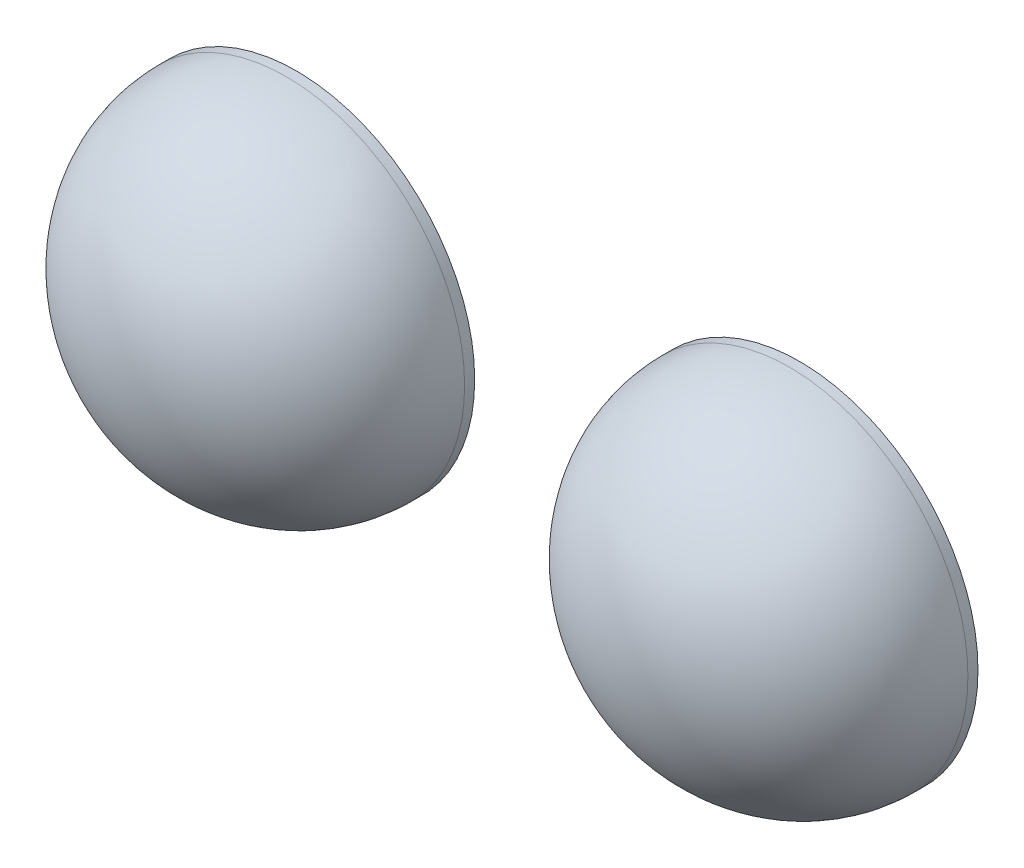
from build123d import *

# Parameters (mm, degrees)
ESQUISSE1_R        = 8.858495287
EXTRUSION1_DEPTH   = 0.5
EXTRUSION1_2_DEPTH = 0.5
D_ME2_FACE_RADIUS  = 8.858495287
D_ME2_HEIGHT       = 8
D_ME3_FACE_RADIUS  = 8.858495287
D_ME3_HEIGHT       = 8


with BuildPart() as part:
    # Esquisse1 → Extrusion1 (new body)
    with BuildSketch(Plane.XY):
        with Locations((12.5, 0)):
            Circle(ESQUISSE1_R)
    extrude(amount=EXTRUSION1_DEPTH)

    # D_me3: an elliptical dome of height H over a round flat face of radius A is half a spheroid: the quarter ellipse of half axes A and H revolved about the face's axis
    with BuildSketch(Plane((12.5, 0, 0.5), x_dir=(0, 1, 0), z_dir=(1, 0, 0)), mode=Mode.PRIVATE) as d_me3_quarter:
        Ellipse(D_ME3_FACE_RADIUS, D_ME3_HEIGHT)
        Rectangle(D_ME3_FACE_RADIUS, D_ME3_HEIGHT, align=(Align.MIN, Align.MIN), mode=Mode.INTERSECT)
    revolve(d_me3_quarter.sketch, axis=Axis((12.5, 0, 0.5), (0, 0, 1)))


with BuildPart() as body_2:
    # Esquisse1 → Extrusion1 2 (new body)
    with BuildSketch(Plane.XY):
        with Locations((-12.5, 0)):
            Circle(ESQUISSE1_R)
    extrude(amount=EXTRUSION1_2_DEPTH)

    # D_me2: an elliptical dome of height H over a round flat face of radius A is half a spheroid: the quarter ellipse of half axes A and H revolved about the face's axis
    with BuildSketch(Plane((-12.5, 0, 0.5), x_dir=(0, 1, 0), z_dir=(1, 0, 0)), mode=Mode.PRIVATE) as d_me2_quarter:
        Ellipse(D_ME2_FACE_RADIUS, D_ME2_HEIGHT)
        Rectangle(D_ME2_FACE_RADIUS, D_ME2_HEIGHT, align=(Align.MIN, Align.MIN), mode=Mode.INTERSECT)
    revolve(d_me2_quarter.sketch, axis=Axis((-12.5, 0, 0.5), (0, 0, 1)))


solid = Compound([part.part, body_2.part])
